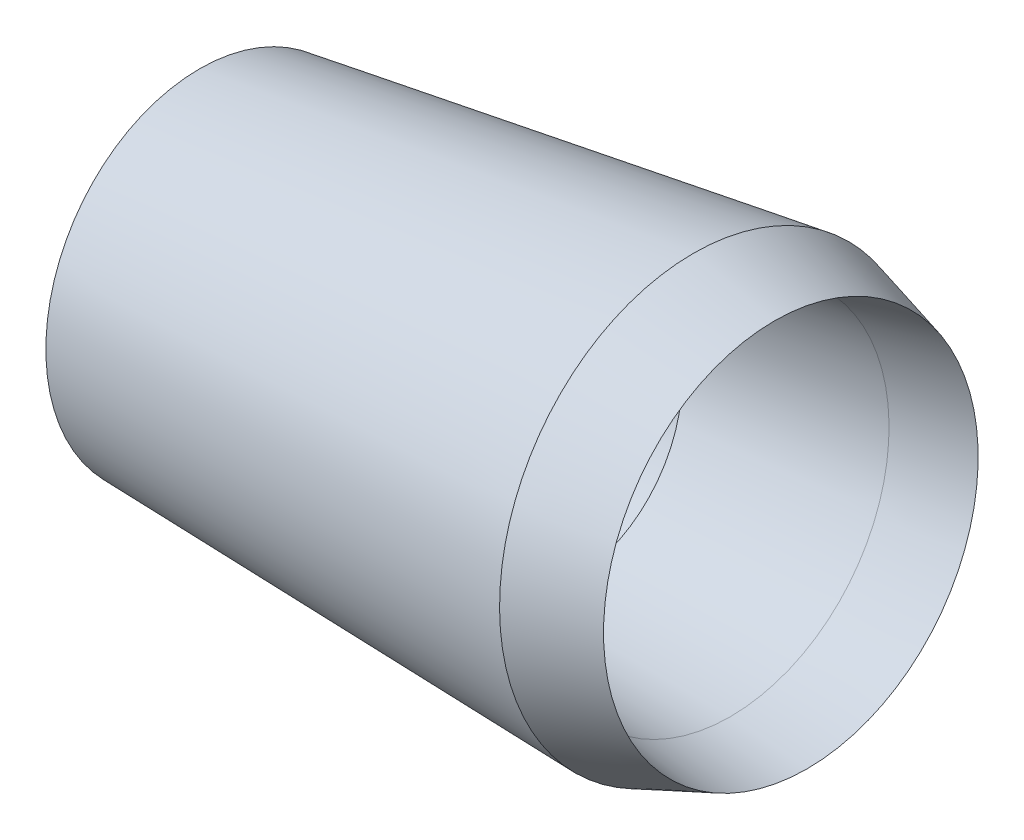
ISO-10303-21;
HEADER;
FILE_DESCRIPTION(('STEP AP214'),'2;1');
FILE_NAME('part.step','',(''),(''),'','','');
FILE_SCHEMA(('AUTOMOTIVE_DESIGN { 1 0 10303 214 1 1 1 1 }'));
ENDSEC;
DATA;
#1=APPLICATION_CONTEXT('core data for automotive mechanical design processes');
#2=APPLICATION_PROTOCOL_DEFINITION('international standard','automotive_design',2000,#1);
#3=PRODUCT_CONTEXT('',#1,'mechanical');
#4=PRODUCT('Part','Part','',(#3));
#5=PRODUCT_RELATED_PRODUCT_CATEGORY('part','',(#4));
#6=PRODUCT_DEFINITION_FORMATION('','',#4);
#7=PRODUCT_DEFINITION_CONTEXT('part definition',#1,'design');
#8=PRODUCT_DEFINITION('design','',#6,#7);
#9=PRODUCT_DEFINITION_SHAPE('','',#8);
#10=(LENGTH_UNIT() NAMED_UNIT(*) SI_UNIT(.MILLI.,.METRE.));
#11=(NAMED_UNIT(*) PLANE_ANGLE_UNIT() SI_UNIT($,.RADIAN.));
#12=(NAMED_UNIT(*) SI_UNIT($,.STERADIAN.) SOLID_ANGLE_UNIT());
#13=UNCERTAINTY_MEASURE_WITH_UNIT(LENGTH_MEASURE(1.E-05),#10,'distance_accuracy_value','');
#14=(GEOMETRIC_REPRESENTATION_CONTEXT(3) GLOBAL_UNCERTAINTY_ASSIGNED_CONTEXT((#13)) GLOBAL_UNIT_ASSIGNED_CONTEXT((#10,
#11,#12)) REPRESENTATION_CONTEXT('',''));
#15=CARTESIAN_POINT('',(0.,0.,0.));
#16=DIRECTION('',(0.,0.,1.));
#17=DIRECTION('',(1.,0.,0.));
#18=AXIS2_PLACEMENT_3D('',#15,#16,#17);
#19=CARTESIAN_POINT('',(207.076644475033,18.1168588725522,0.));
#20=DIRECTION('',(0.996194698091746,0.0871557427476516,0.));
#21=DIRECTION('',(-0.0871557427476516,0.996194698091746,0.));
#22=AXIS2_PLACEMENT_3D('',#19,#20,#21);
#23=PLANE('',#22);
#24=CARTESIAN_POINT('',(206.799924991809,21.2797770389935,0.));
#25=DIRECTION('',(0.996194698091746,0.0871557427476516,0.));
#26=DIRECTION('',(-0.0871557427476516,0.996194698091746,0.));
#27=AXIS2_PLACEMENT_3D('',#24,#25,#26);
#28=CIRCLE('',#27,21.3610623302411);
#29=CARTESIAN_POINT('',(204.938185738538,42.559554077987,0.));
#30=VERTEX_POINT('',#29);
#31=EDGE_CURVE('E127',#30,#30,#28,.T.);
#32=ORIENTED_EDGE('',*,*,#31,.T.);
#33=EDGE_LOOP('',(#32));
#34=FACE_BOUND('',#33,.T.);
#35=CARTESIAN_POINT('',(206.799924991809,21.2797770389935,0.));
#36=DIRECTION('',(0.996194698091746,0.0871557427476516,0.));
#37=DIRECTION('',(-0.0871557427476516,0.996194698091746,0.));
#38=AXIS2_PLACEMENT_3D('',#35,#36,#37);
#39=CIRCLE('',#38,27.7353182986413);
#40=CARTESIAN_POINT('',(204.382632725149,48.909554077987,0.));
#41=VERTEX_POINT('',#40);
#42=EDGE_CURVE('E11',#41,#41,#39,.F.);
#43=ORIENTED_EDGE('',*,*,#42,.T.);
#44=EDGE_LOOP('',(#43));
#45=FACE_BOUND('',#44,.T.);
#46=ADVANCED_FACE('F43',(#34,#45),#23,.F.);
#47=CARTESIAN_POINT('',(213.653022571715,21.8793453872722,0.));
#48=DIRECTION('',(-0.996194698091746,-0.0871557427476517,0.));
#49=DIRECTION('',(0.0871557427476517,-0.996194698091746,0.));
#50=AXIS2_PLACEMENT_3D('',#47,#48,#49);
#51=CONICAL_SURFACE('',#50,15.5886649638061,0.698131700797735);
#52=ORIENTED_EDGE('',*,*,#31,.F.);
#53=EDGE_LOOP('',(#52));
#54=FACE_BOUND('',#53,.T.);
#55=CARTESIAN_POINT('',(213.653022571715,21.8793453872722,0.));
#56=DIRECTION('',(-0.996194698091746,-0.0871557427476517,0.));
#57=DIRECTION('',(0.0871557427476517,-0.996194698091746,0.));
#58=AXIS2_PLACEMENT_3D('',#55,#56,#57);
#59=CIRCLE('',#58,15.5886649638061);
#60=CARTESIAN_POINT('',(215.01166424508,6.35,0.));
#61=VERTEX_POINT('',#60);
#62=EDGE_CURVE('E51',#61,#61,#59,.T.);
#63=ORIENTED_EDGE('',*,*,#62,.F.);
#64=EDGE_LOOP('',(#63));
#65=FACE_BOUND('',#64,.T.);
#66=ADVANCED_FACE('F45',(#54,#65),#51,.F.);
#67=CARTESIAN_POINT('',(216.803904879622,22.1550118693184,0.));
#68=DIRECTION('',(0.996194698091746,0.0871557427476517,0.));
#69=DIRECTION('',(-0.0871557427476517,0.996194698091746,0.));
#70=AXIS2_PLACEMENT_3D('',#67,#68,#69);
#71=CONICAL_SURFACE('',#70,15.8653844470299,0.0872664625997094);
#72=ORIENTED_EDGE('',*,*,#62,.T.);
#73=EDGE_LOOP('',(#72));
#74=FACE_BOUND('',#73,.T.);
#75=CARTESIAN_POINT('',(216.803904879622,22.1550118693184,0.));
#76=DIRECTION('',(-0.996194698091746,-0.0871557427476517,0.));
#77=DIRECTION('',(0.0871557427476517,-0.996194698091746,0.));
#78=AXIS2_PLACEMENT_3D('',#75,#76,#77);
#79=CIRCLE('',#78,15.8653844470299);
#80=CARTESIAN_POINT('',(218.18666424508,6.35,0.));
#81=VERTEX_POINT('',#80);
#82=EDGE_CURVE('E56',#81,#81,#79,.T.);
#83=ORIENTED_EDGE('',*,*,#82,.F.);
#84=EDGE_LOOP('',(#83));
#85=FACE_BOUND('',#84,.T.);
#86=ADVANCED_FACE('F135',(#74,#85),#71,.F.);
#87=CARTESIAN_POINT('',(209.950807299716,21.5554435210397,0.));
#88=DIRECTION('',(-0.996194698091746,-0.0871557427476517,0.));
#89=DIRECTION('',(0.0871557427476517,-0.996194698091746,0.));
#90=AXIS2_PLACEMENT_3D('',#87,#88,#89);
#91=CONICAL_SURFACE('',#90,21.6377818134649,0.698131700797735);
#92=ORIENTED_EDGE('',*,*,#82,.T.);
#93=EDGE_LOOP('',(#92));
#94=FACE_BOUND('',#93,.T.);
#95=CARTESIAN_POINT('',(209.950807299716,21.5554435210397,0.));
#96=DIRECTION('',(-0.996194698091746,-0.0871557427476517,0.));
#97=DIRECTION('',(0.0871557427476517,-0.996194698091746,0.));
#98=AXIS2_PLACEMENT_3D('',#95,#96,#97);
#99=CIRCLE('',#98,21.6377818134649);
#100=CARTESIAN_POINT('',(211.83666424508,0.,0.));
#101=VERTEX_POINT('',#100);
#102=EDGE_CURVE('E61',#101,#101,#99,.T.);
#103=ORIENTED_EDGE('',*,*,#102,.F.);
#104=EDGE_LOOP('',(#103));
#105=FACE_BOUND('',#104,.T.);
#106=ADVANCED_FACE('F140',(#94,#105),#91,.T.);
#107=CARTESIAN_POINT('',(222.554336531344,22.6581094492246,0.));
#108=DIRECTION('',(0.996194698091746,0.0871557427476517,0.));
#109=DIRECTION('',(-0.0871557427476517,0.996194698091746,0.));
#110=AXIS2_PLACEMENT_3D('',#107,#108,#109);
#111=CONICAL_SURFACE('',#110,22.7446597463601,0.0872664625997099);
#112=ORIENTED_EDGE('',*,*,#102,.T.);
#113=EDGE_LOOP('',(#112));
#114=FACE_BOUND('',#113,.T.);
#115=CARTESIAN_POINT('',(222.554336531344,22.6581094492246,0.));
#116=DIRECTION('',(-0.996194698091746,-0.0871557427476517,0.));
#117=DIRECTION('',(0.0871557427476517,-0.996194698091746,0.));
#118=AXIS2_PLACEMENT_3D('',#115,#116,#117);
#119=CIRCLE('',#118,22.7446597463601);
#120=CARTESIAN_POINT('',(224.53666424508,0.,0.));
#121=VERTEX_POINT('',#120);
#122=EDGE_CURVE('E67',#121,#121,#119,.T.);
#123=ORIENTED_EDGE('',*,*,#122,.F.);
#124=EDGE_LOOP('',(#123));
#125=FACE_BOUND('',#124,.T.);
#126=ADVANCED_FACE('F204',(#114,#125),#111,.F.);
#127=CARTESIAN_POINT('',(229.40743411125,23.2576777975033,0.));
#128=DIRECTION('',(-0.996194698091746,-0.0871557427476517,0.));
#129=DIRECTION('',(0.0871557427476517,-0.996194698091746,0.));
#130=AXIS2_PLACEMENT_3D('',#127,#128,#129);
#131=CONICAL_SURFACE('',#130,16.9722623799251,0.698131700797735);
#132=ORIENTED_EDGE('',*,*,#122,.T.);
#133=EDGE_LOOP('',(#132));
#134=FACE_BOUND('',#133,.T.);
#135=CARTESIAN_POINT('',(229.40743411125,23.2576777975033,0.));
#136=DIRECTION('',(-0.996194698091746,-0.0871557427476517,0.));
#137=DIRECTION('',(0.0871557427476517,-0.996194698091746,0.));
#138=AXIS2_PLACEMENT_3D('',#135,#136,#137);
#139=CIRCLE('',#138,16.9722623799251);
#140=CARTESIAN_POINT('',(230.88666424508,6.35,0.));
#141=VERTEX_POINT('',#140);
#142=EDGE_CURVE('E71',#141,#141,#139,.T.);
#143=ORIENTED_EDGE('',*,*,#142,.F.);
#144=EDGE_LOOP('',(#143));
#145=FACE_BOUND('',#144,.T.);
#146=ADVANCED_FACE('F200',(#134,#145),#131,.F.);
#147=CARTESIAN_POINT('',(232.558316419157,23.5333442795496,0.));
#148=DIRECTION('',(0.996194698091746,0.0871557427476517,0.));
#149=DIRECTION('',(-0.0871557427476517,0.996194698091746,0.));
#150=AXIS2_PLACEMENT_3D('',#147,#148,#149);
#151=CONICAL_SURFACE('',#150,17.2489818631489,0.0872664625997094);
#152=ORIENTED_EDGE('',*,*,#142,.T.);
#153=EDGE_LOOP('',(#152));
#154=FACE_BOUND('',#153,.T.);
#155=CARTESIAN_POINT('',(232.558316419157,23.5333442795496,0.));
#156=DIRECTION('',(-0.996194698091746,-0.0871557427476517,0.));
#157=DIRECTION('',(0.0871557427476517,-0.996194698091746,0.));
#158=AXIS2_PLACEMENT_3D('',#155,#156,#157);
#159=CIRCLE('',#158,17.2489818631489);
#160=CARTESIAN_POINT('',(234.06166424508,6.35,0.));
#161=VERTEX_POINT('',#160);
#162=EDGE_CURVE('E75',#161,#161,#159,.T.);
#163=ORIENTED_EDGE('',*,*,#162,.F.);
#164=EDGE_LOOP('',(#163));
#165=FACE_BOUND('',#164,.T.);
#166=ADVANCED_FACE('F196',(#154,#165),#151,.F.);
#167=CARTESIAN_POINT('',(225.70521883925,22.9337759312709,0.));
#168=DIRECTION('',(-0.996194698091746,-0.0871557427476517,0.));
#169=DIRECTION('',(0.0871557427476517,-0.996194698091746,0.));
#170=AXIS2_PLACEMENT_3D('',#167,#168,#169);
#171=CONICAL_SURFACE('',#170,23.0213792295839,0.698131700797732);
#172=ORIENTED_EDGE('',*,*,#162,.T.);
#173=EDGE_LOOP('',(#172));
#174=FACE_BOUND('',#173,.T.);
#175=CARTESIAN_POINT('',(225.70521883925,22.9337759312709,0.));
#176=DIRECTION('',(-0.996194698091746,-0.0871557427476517,0.));
#177=DIRECTION('',(0.0871557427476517,-0.996194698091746,0.));
#178=AXIS2_PLACEMENT_3D('',#175,#176,#177);
#179=CIRCLE('',#178,23.0213792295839);
#180=CARTESIAN_POINT('',(227.71166424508,0.,0.));
#181=VERTEX_POINT('',#180);
#182=EDGE_CURVE('E79',#181,#181,#179,.T.);
#183=ORIENTED_EDGE('',*,*,#182,.F.);
#184=EDGE_LOOP('',(#183));
#185=FACE_BOUND('',#184,.T.);
#186=ADVANCED_FACE('F192',(#174,#185),#171,.T.);
#187=CARTESIAN_POINT('',(238.308748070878,24.0364418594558,0.));
#188=DIRECTION('',(0.996194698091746,0.0871557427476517,0.));
#189=DIRECTION('',(-0.0871557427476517,0.996194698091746,0.));
#190=AXIS2_PLACEMENT_3D('',#187,#188,#189);
#191=CONICAL_SURFACE('',#190,24.128257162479,0.0872664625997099);
#192=ORIENTED_EDGE('',*,*,#182,.T.);
#193=EDGE_LOOP('',(#192));
#194=FACE_BOUND('',#193,.T.);
#195=CARTESIAN_POINT('',(238.308748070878,24.0364418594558,0.));
#196=DIRECTION('',(-0.996194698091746,-0.0871557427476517,0.));
#197=DIRECTION('',(0.0871557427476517,-0.996194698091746,0.));
#198=AXIS2_PLACEMENT_3D('',#195,#196,#197);
#199=CIRCLE('',#198,24.128257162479);
#200=CARTESIAN_POINT('',(240.41166424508,0.,0.));
#201=VERTEX_POINT('',#200);
#202=EDGE_CURVE('E83',#201,#201,#199,.T.);
#203=ORIENTED_EDGE('',*,*,#202,.F.);
#204=EDGE_LOOP('',(#203));
#205=FACE_BOUND('',#204,.T.);
#206=ADVANCED_FACE('F188',(#194,#205),#191,.F.);
#207=CARTESIAN_POINT('',(245.161845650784,24.6360102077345,0.));
#208=DIRECTION('',(-0.996194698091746,-0.0871557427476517,0.));
#209=DIRECTION('',(0.0871557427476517,-0.996194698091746,0.));
#210=AXIS2_PLACEMENT_3D('',#207,#208,#209);
#211=CONICAL_SURFACE('',#210,18.355859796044,0.698131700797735);
#212=ORIENTED_EDGE('',*,*,#202,.T.);
#213=EDGE_LOOP('',(#212));
#214=FACE_BOUND('',#213,.T.);
#215=CARTESIAN_POINT('',(245.161845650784,24.6360102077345,0.));
#216=DIRECTION('',(-0.996194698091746,-0.0871557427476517,0.));
#217=DIRECTION('',(0.0871557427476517,-0.996194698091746,0.));
#218=AXIS2_PLACEMENT_3D('',#215,#216,#217);
#219=CIRCLE('',#218,18.355859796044);
#220=CARTESIAN_POINT('',(246.76166424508,6.35,0.));
#221=VERTEX_POINT('',#220);
#222=EDGE_CURVE('E87',#221,#221,#219,.T.);
#223=ORIENTED_EDGE('',*,*,#222,.F.);
#224=EDGE_LOOP('',(#223));
#225=FACE_BOUND('',#224,.T.);
#226=ADVANCED_FACE('F184',(#214,#225),#211,.F.);
#227=CARTESIAN_POINT('',(248.312727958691,24.9116766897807,0.));
#228=DIRECTION('',(0.996194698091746,0.0871557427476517,0.));
#229=DIRECTION('',(-0.0871557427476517,0.996194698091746,0.));
#230=AXIS2_PLACEMENT_3D('',#227,#228,#229);
#231=CONICAL_SURFACE('',#230,18.6325792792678,0.0872664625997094);
#232=ORIENTED_EDGE('',*,*,#222,.T.);
#233=EDGE_LOOP('',(#232));
#234=FACE_BOUND('',#233,.T.);
#235=CARTESIAN_POINT('',(248.312727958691,24.9116766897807,0.));
#236=DIRECTION('',(-0.996194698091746,-0.0871557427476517,0.));
#237=DIRECTION('',(0.0871557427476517,-0.996194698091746,0.));
#238=AXIS2_PLACEMENT_3D('',#235,#236,#237);
#239=CIRCLE('',#238,18.6325792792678);
#240=CARTESIAN_POINT('',(249.93666424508,6.35,0.));
#241=VERTEX_POINT('',#240);
#242=EDGE_CURVE('E91',#241,#241,#239,.T.);
#243=ORIENTED_EDGE('',*,*,#242,.F.);
#244=EDGE_LOOP('',(#243));
#245=FACE_BOUND('',#244,.T.);
#246=ADVANCED_FACE('F180',(#234,#245),#231,.F.);
#247=CARTESIAN_POINT('',(241.459630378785,24.312108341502,0.));
#248=DIRECTION('',(-0.996194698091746,-0.0871557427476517,0.));
#249=DIRECTION('',(0.0871557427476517,-0.996194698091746,0.));
#250=AXIS2_PLACEMENT_3D('',#247,#248,#249);
#251=CONICAL_SURFACE('',#250,24.4049766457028,0.698131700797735);
#252=ORIENTED_EDGE('',*,*,#242,.T.);
#253=EDGE_LOOP('',(#252));
#254=FACE_BOUND('',#253,.T.);
#255=CARTESIAN_POINT('',(241.459630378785,24.312108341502,0.));
#256=DIRECTION('',(-0.996194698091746,-0.0871557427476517,0.));
#257=DIRECTION('',(0.0871557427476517,-0.996194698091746,0.));
#258=AXIS2_PLACEMENT_3D('',#255,#256,#257);
#259=CIRCLE('',#258,24.4049766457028);
#260=CARTESIAN_POINT('',(243.58666424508,0.,0.));
#261=VERTEX_POINT('',#260);
#262=EDGE_CURVE('E95',#261,#261,#259,.T.);
#263=ORIENTED_EDGE('',*,*,#262,.F.);
#264=EDGE_LOOP('',(#263));
#265=FACE_BOUND('',#264,.T.);
#266=ADVANCED_FACE('F176',(#254,#265),#251,.T.);
#267=CARTESIAN_POINT('',(254.063159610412,25.414774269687,0.));
#268=DIRECTION('',(0.996194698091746,0.0871557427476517,0.));
#269=DIRECTION('',(-0.0871557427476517,0.996194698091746,0.));
#270=AXIS2_PLACEMENT_3D('',#267,#268,#269);
#271=CONICAL_SURFACE('',#270,25.511854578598,0.0872664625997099);
#272=ORIENTED_EDGE('',*,*,#262,.T.);
#273=EDGE_LOOP('',(#272));
#274=FACE_BOUND('',#273,.T.);
#275=CARTESIAN_POINT('',(254.063159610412,25.414774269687,0.));
#276=DIRECTION('',(-0.996194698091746,-0.0871557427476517,0.));
#277=DIRECTION('',(0.0871557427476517,-0.996194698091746,0.));
#278=AXIS2_PLACEMENT_3D('',#275,#276,#277);
#279=CIRCLE('',#278,25.511854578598);
#280=CARTESIAN_POINT('',(256.28666424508,0.,0.));
#281=VERTEX_POINT('',#280);
#282=EDGE_CURVE('E99',#281,#281,#279,.T.);
#283=ORIENTED_EDGE('',*,*,#282,.F.);
#284=EDGE_LOOP('',(#283));
#285=FACE_BOUND('',#284,.T.);
#286=ADVANCED_FACE('F172',(#274,#285),#271,.F.);
#287=CARTESIAN_POINT('',(260.916257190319,26.0143426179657,0.));
#288=DIRECTION('',(-0.996194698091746,-0.0871557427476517,0.));
#289=DIRECTION('',(0.0871557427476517,-0.996194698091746,0.));
#290=AXIS2_PLACEMENT_3D('',#287,#288,#289);
#291=CONICAL_SURFACE('',#290,19.739457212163,0.698131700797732);
#292=ORIENTED_EDGE('',*,*,#282,.T.);
#293=EDGE_LOOP('',(#292));
#294=FACE_BOUND('',#293,.T.);
#295=CARTESIAN_POINT('',(260.916257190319,26.0143426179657,0.));
#296=DIRECTION('',(-0.996194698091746,-0.0871557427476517,0.));
#297=DIRECTION('',(0.0871557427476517,-0.996194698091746,0.));
#298=AXIS2_PLACEMENT_3D('',#295,#296,#297);
#299=CIRCLE('',#298,19.739457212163);
#300=CARTESIAN_POINT('',(262.63666424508,6.35,0.));
#301=VERTEX_POINT('',#300);
#302=EDGE_CURVE('E103',#301,#301,#299,.T.);
#303=ORIENTED_EDGE('',*,*,#302,.F.);
#304=EDGE_LOOP('',(#303));
#305=FACE_BOUND('',#304,.T.);
#306=ADVANCED_FACE('F168',(#294,#305),#291,.F.);
#307=CARTESIAN_POINT('',(264.067139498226,26.2900091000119,0.));
#308=DIRECTION('',(0.996194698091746,0.0871557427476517,0.));
#309=DIRECTION('',(-0.0871557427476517,0.996194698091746,0.));
#310=AXIS2_PLACEMENT_3D('',#307,#308,#309);
#311=CONICAL_SURFACE('',#310,20.0161766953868,0.0872664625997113);
#312=ORIENTED_EDGE('',*,*,#302,.T.);
#313=EDGE_LOOP('',(#312));
#314=FACE_BOUND('',#313,.T.);
#315=CARTESIAN_POINT('',(264.067139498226,26.2900091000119,0.));
#316=DIRECTION('',(-0.996194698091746,-0.0871557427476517,0.));
#317=DIRECTION('',(0.0871557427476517,-0.996194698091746,0.));
#318=AXIS2_PLACEMENT_3D('',#315,#316,#317);
#319=CIRCLE('',#318,20.0161766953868);
#320=CARTESIAN_POINT('',(265.81166424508,6.34999999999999,0.));
#321=VERTEX_POINT('',#320);
#322=EDGE_CURVE('E107',#321,#321,#319,.T.);
#323=ORIENTED_EDGE('',*,*,#322,.F.);
#324=EDGE_LOOP('',(#323));
#325=FACE_BOUND('',#324,.T.);
#326=ADVANCED_FACE('F164',(#314,#325),#311,.F.);
#327=CARTESIAN_POINT('',(257.214041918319,25.6904407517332,0.));
#328=DIRECTION('',(-0.996194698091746,-0.0871557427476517,0.));
#329=DIRECTION('',(0.0871557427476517,-0.996194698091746,0.));
#330=AXIS2_PLACEMENT_3D('',#327,#328,#329);
#331=CONICAL_SURFACE('',#330,25.7885740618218,0.698131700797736);
#332=ORIENTED_EDGE('',*,*,#322,.T.);
#333=EDGE_LOOP('',(#332));
#334=FACE_BOUND('',#333,.T.);
#335=CARTESIAN_POINT('',(257.214041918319,25.6904407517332,0.));
#336=DIRECTION('',(-0.996194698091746,-0.0871557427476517,0.));
#337=DIRECTION('',(0.0871557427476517,-0.996194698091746,0.));
#338=AXIS2_PLACEMENT_3D('',#335,#336,#337);
#339=CIRCLE('',#338,25.7885740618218);
#340=CARTESIAN_POINT('',(259.46166424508,0.,0.));
#341=VERTEX_POINT('',#340);
#342=EDGE_CURVE('E111',#341,#341,#339,.T.);
#343=ORIENTED_EDGE('',*,*,#342,.F.);
#344=EDGE_LOOP('',(#343));
#345=FACE_BOUND('',#344,.T.);
#346=ADVANCED_FACE('F160',(#334,#345),#331,.T.);
#347=CARTESIAN_POINT('',(289.60445284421,28.5242345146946,0.));
#348=DIRECTION('',(0.996194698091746,0.0871557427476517,0.));
#349=DIRECTION('',(-0.0871557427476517,0.996194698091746,0.));
#350=AXIS2_PLACEMENT_3D('',#347,#348,#349);
#351=CONICAL_SURFACE('',#350,28.6331924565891,0.0872664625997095);
#352=ORIENTED_EDGE('',*,*,#342,.T.);
#353=EDGE_LOOP('',(#352));
#354=FACE_BOUND('',#353,.T.);
#355=CARTESIAN_POINT('',(289.60445284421,28.5242345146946,0.));
#356=DIRECTION('',(-0.996194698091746,-0.0871557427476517,0.));
#357=DIRECTION('',(0.0871557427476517,-0.996194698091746,0.));
#358=AXIS2_PLACEMENT_3D('',#355,#356,#357);
#359=CIRCLE('',#358,28.6331924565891);
#360=CARTESIAN_POINT('',(292.1,0.,0.));
#361=VERTEX_POINT('',#360);
#362=EDGE_CURVE('E115',#361,#361,#359,.T.);
#363=ORIENTED_EDGE('',*,*,#362,.F.);
#364=EDGE_LOOP('',(#363));
#365=FACE_BOUND('',#364,.T.);
#366=ADVANCED_FACE('F156',(#354,#365),#351,.F.);
#367=CARTESIAN_POINT('',(302.111511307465,29.6184603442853,0.));
#368=DIRECTION('',(0.996194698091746,0.0871557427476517,0.));
#369=DIRECTION('',(-0.0871557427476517,0.996194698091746,0.));
#370=AXIS2_PLACEMENT_3D('',#367,#368,#369);
#371=CONICAL_SURFACE('',#370,30.8469483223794,0.17453292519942);
#372=ORIENTED_EDGE('',*,*,#362,.T.);
#373=EDGE_LOOP('',(#372));
#374=FACE_BOUND('',#373,.T.);
#375=CARTESIAN_POINT('',(302.111511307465,29.6184603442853,0.));
#376=DIRECTION('',(-0.996194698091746,-0.0871557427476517,0.));
#377=DIRECTION('',(0.0871557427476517,-0.996194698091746,0.));
#378=AXIS2_PLACEMENT_3D('',#375,#376,#377);
#379=CIRCLE('',#378,30.8469483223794);
#380=CARTESIAN_POINT('',(304.8,-1.11110602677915,0.));
#381=VERTEX_POINT('',#380);
#382=EDGE_CURVE('E119',#381,#381,#379,.T.);
#383=ORIENTED_EDGE('',*,*,#382,.F.);
#384=EDGE_LOOP('',(#383));
#385=FACE_BOUND('',#384,.T.);
#386=ADVANCED_FACE('F152',(#374,#385),#371,.F.);
#387=CARTESIAN_POINT('',(289.053119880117,28.4759991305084,0.));
#388=DIRECTION('',(-0.996194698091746,-0.0871557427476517,0.));
#389=DIRECTION('',(0.0871557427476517,-0.996194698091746,0.));
#390=AXIS2_PLACEMENT_3D('',#387,#388,#389);
#391=CONICAL_SURFACE('',#390,34.9590287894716,0.303978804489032);
#392=ORIENTED_EDGE('',*,*,#382,.T.);
#393=EDGE_LOOP('',(#392));
#394=FACE_BOUND('',#393,.T.);
#395=CARTESIAN_POINT('',(289.053119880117,28.4759991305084,0.));
#396=DIRECTION('',(-0.996194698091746,-0.0871557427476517,0.));
#397=DIRECTION('',(0.0871557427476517,-0.996194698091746,0.));
#398=AXIS2_PLACEMENT_3D('',#395,#396,#397);
#399=CIRCLE('',#398,34.9590287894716);
#400=CARTESIAN_POINT('',(292.1,-6.34999999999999,0.));
#401=VERTEX_POINT('',#400);
#402=EDGE_CURVE('E123',#401,#401,#399,.T.);
#403=ORIENTED_EDGE('',*,*,#402,.F.);
#404=EDGE_LOOP('',(#403));
#405=FACE_BOUND('',#404,.T.);
#406=ADVANCED_FACE('F148',(#394,#405),#391,.T.);
#407=CARTESIAN_POINT('',(200.828415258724,20.7573376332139,0.));
#408=DIRECTION('',(0.996194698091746,0.0871557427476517,0.));
#409=DIRECTION('',(-0.0871557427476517,0.996194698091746,0.));
#410=AXIS2_PLACEMENT_3D('',#407,#408,#409);
#411=CONICAL_SURFACE('',#410,27.2108832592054,0.0872664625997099);
#412=ORIENTED_EDGE('',*,*,#42,.F.);
#413=EDGE_LOOP('',(#412));
#414=FACE_BOUND('',#413,.T.);
#415=ORIENTED_EDGE('',*,*,#402,.T.);
#416=EDGE_LOOP('',(#415));
#417=FACE_BOUND('',#416,.T.);
#418=ADVANCED_FACE('F145',(#414,#417),#411,.T.);
#419=CLOSED_SHELL('',(#46,#66,#86,#106,#126,#146,#166,#186,#206,#226,#246,#266,#286,#306,#326,
#346,#366,#386,#406,#418));
#420=MANIFOLD_SOLID_BREP('B2',#419);
#421=ADVANCED_BREP_SHAPE_REPRESENTATION('',(#18,#420),#14);
#422=SHAPE_DEFINITION_REPRESENTATION(#9,#421);
ENDSEC;
END-ISO-10303-21;
